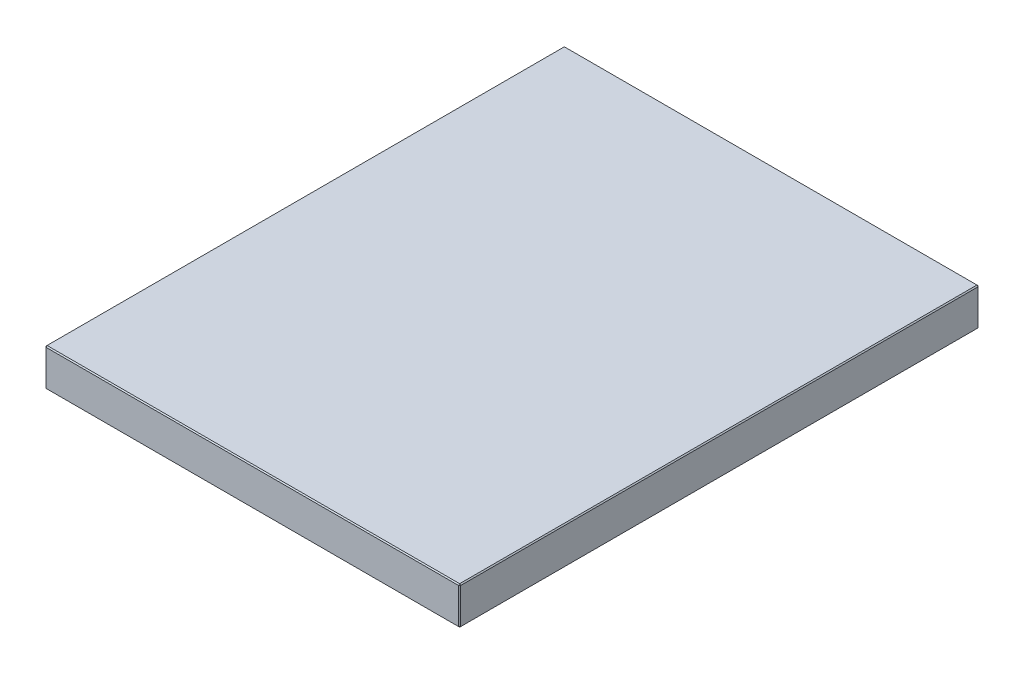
ISO-10303-21;
HEADER;
FILE_DESCRIPTION(('STEP AP214'),'2;1');
FILE_NAME('part.step','',(''),(''),'','','');
FILE_SCHEMA(('AUTOMOTIVE_DESIGN { 1 0 10303 214 1 1 1 1 }'));
ENDSEC;
DATA;
#1=APPLICATION_CONTEXT('core data for automotive mechanical design processes');
#2=APPLICATION_PROTOCOL_DEFINITION('international standard','automotive_design',2000,#1);
#3=PRODUCT_CONTEXT('',#1,'mechanical');
#4=PRODUCT('Part','Part','',(#3));
#5=PRODUCT_RELATED_PRODUCT_CATEGORY('part','',(#4));
#6=PRODUCT_DEFINITION_FORMATION('','',#4);
#7=PRODUCT_DEFINITION_CONTEXT('part definition',#1,'design');
#8=PRODUCT_DEFINITION('design','',#6,#7);
#9=PRODUCT_DEFINITION_SHAPE('','',#8);
#10=(LENGTH_UNIT() NAMED_UNIT(*) SI_UNIT(.MILLI.,.METRE.));
#11=(NAMED_UNIT(*) PLANE_ANGLE_UNIT() SI_UNIT($,.RADIAN.));
#12=(NAMED_UNIT(*) SI_UNIT($,.STERADIAN.) SOLID_ANGLE_UNIT());
#13=UNCERTAINTY_MEASURE_WITH_UNIT(LENGTH_MEASURE(1.E-05),#10,'distance_accuracy_value','');
#14=(GEOMETRIC_REPRESENTATION_CONTEXT(3) GLOBAL_UNCERTAINTY_ASSIGNED_CONTEXT((#13)) GLOBAL_UNIT_ASSIGNED_CONTEXT((#10,
#11,#12)) REPRESENTATION_CONTEXT('',''));
#15=CARTESIAN_POINT('',(0.,0.,0.));
#16=DIRECTION('',(0.,0.,1.));
#17=DIRECTION('',(1.,0.,0.));
#18=AXIS2_PLACEMENT_3D('',#15,#16,#17);
#19=CARTESIAN_POINT('',(-198.,36.,248.));
#20=DIRECTION('',(1.,0.,0.));
#21=DIRECTION('',(0.,0.,-1.));
#22=AXIS2_PLACEMENT_3D('',#19,#20,#21);
#23=PLANE('',#22);
#24=DIRECTION('',(0.,-1.,0.));
#25=VECTOR('',#24,1.);
#26=CARTESIAN_POINT('',(-198.,36.,-247.));
#27=LINE('',#26,#25);
#28=CARTESIAN_POINT('',(-198.,35.,-247.));
#29=VERTEX_POINT('',#28);
#30=CARTESIAN_POINT('',(-198.,1.00000000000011,-247.));
#31=VERTEX_POINT('',#30);
#32=EDGE_CURVE('E114',#29,#31,#27,.T.);
#33=ORIENTED_EDGE('',*,*,#32,.T.);
#34=DIRECTION('',(0.,0.,1.));
#35=VECTOR('',#34,1.);
#36=CARTESIAN_POINT('',(-198.,1.00000000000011,248.));
#37=LINE('',#36,#35);
#38=CARTESIAN_POINT('',(-198.,1.00000000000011,247.));
#39=VERTEX_POINT('',#38);
#40=EDGE_CURVE('E110',#31,#39,#37,.T.);
#41=ORIENTED_EDGE('',*,*,#40,.T.);
#42=DIRECTION('',(0.,1.,0.));
#43=VECTOR('',#42,1.);
#44=CARTESIAN_POINT('',(-198.,36.,247.));
#45=LINE('',#44,#43);
#46=CARTESIAN_POINT('',(-198.,35.,247.));
#47=VERTEX_POINT('',#46);
#48=EDGE_CURVE('E103',#39,#47,#45,.T.);
#49=ORIENTED_EDGE('',*,*,#48,.T.);
#50=DIRECTION('',(0.,0.,-1.));
#51=VECTOR('',#50,1.);
#52=CARTESIAN_POINT('',(-198.,35.,-248.));
#53=LINE('',#52,#51);
#54=EDGE_CURVE('E107',#47,#29,#53,.T.);
#55=ORIENTED_EDGE('',*,*,#54,.T.);
#56=EDGE_LOOP('',(#33,#41,#49,#55));
#57=FACE_BOUND('',#56,.T.);
#58=ADVANCED_FACE('F15',(#57),#23,.F.);
#59=CARTESIAN_POINT('',(198.,36.,248.));
#60=DIRECTION('',(0.,0.,-1.));
#61=DIRECTION('',(-1.,0.,0.));
#62=AXIS2_PLACEMENT_3D('',#59,#60,#61);
#63=PLANE('',#62);
#64=DIRECTION('',(-1.,0.,0.));
#65=VECTOR('',#64,1.);
#66=CARTESIAN_POINT('',(-198.,35.,248.));
#67=LINE('',#66,#65);
#68=CARTESIAN_POINT('',(197.,35.,248.));
#69=VERTEX_POINT('',#68);
#70=CARTESIAN_POINT('',(-197.,35.,248.));
#71=VERTEX_POINT('',#70);
#72=EDGE_CURVE('E164',#69,#71,#67,.T.);
#73=ORIENTED_EDGE('',*,*,#72,.T.);
#74=DIRECTION('',(0.,-1.,0.));
#75=VECTOR('',#74,1.);
#76=CARTESIAN_POINT('',(-197.,36.,248.));
#77=LINE('',#76,#75);
#78=CARTESIAN_POINT('',(-197.,1.00000000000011,248.));
#79=VERTEX_POINT('',#78);
#80=EDGE_CURVE('E122',#71,#79,#77,.T.);
#81=ORIENTED_EDGE('',*,*,#80,.T.);
#82=DIRECTION('',(1.,0.,0.));
#83=VECTOR('',#82,1.);
#84=CARTESIAN_POINT('',(198.,1.00000000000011,248.));
#85=LINE('',#84,#83);
#86=CARTESIAN_POINT('',(197.,1.00000000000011,248.));
#87=VERTEX_POINT('',#86);
#88=EDGE_CURVE('E168',#79,#87,#85,.T.);
#89=ORIENTED_EDGE('',*,*,#88,.T.);
#90=DIRECTION('',(0.,1.,0.));
#91=VECTOR('',#90,1.);
#92=CARTESIAN_POINT('',(197.,36.,248.));
#93=LINE('',#92,#91);
#94=EDGE_CURVE('E166',#87,#69,#93,.T.);
#95=ORIENTED_EDGE('',*,*,#94,.T.);
#96=EDGE_LOOP('',(#73,#81,#89,#95));
#97=FACE_BOUND('',#96,.T.);
#98=ADVANCED_FACE('F275',(#97),#63,.F.);
#99=CARTESIAN_POINT('',(198.,36.,248.));
#100=DIRECTION('',(-1.,0.,0.));
#101=DIRECTION('',(0.,0.,1.));
#102=AXIS2_PLACEMENT_3D('',#99,#100,#101);
#103=PLANE('',#102);
#104=DIRECTION('',(0.,0.,-1.));
#105=VECTOR('',#104,1.);
#106=CARTESIAN_POINT('',(198.,1.00000000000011,248.));
#107=LINE('',#106,#105);
#108=CARTESIAN_POINT('',(198.,1.00000000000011,247.));
#109=VERTEX_POINT('',#108);
#110=CARTESIAN_POINT('',(198.,1.00000000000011,-247.));
#111=VERTEX_POINT('',#110);
#112=EDGE_CURVE('E159',#109,#111,#107,.T.);
#113=ORIENTED_EDGE('',*,*,#112,.T.);
#114=DIRECTION('',(0.,1.,0.));
#115=VECTOR('',#114,1.);
#116=CARTESIAN_POINT('',(198.,36.,-247.));
#117=LINE('',#116,#115);
#118=CARTESIAN_POINT('',(198.,35.,-247.));
#119=VERTEX_POINT('',#118);
#120=EDGE_CURVE('E161',#111,#119,#117,.T.);
#121=ORIENTED_EDGE('',*,*,#120,.T.);
#122=DIRECTION('',(0.,0.,1.));
#123=VECTOR('',#122,1.);
#124=CARTESIAN_POINT('',(198.,35.,248.));
#125=LINE('',#124,#123);
#126=CARTESIAN_POINT('',(198.,35.,247.));
#127=VERTEX_POINT('',#126);
#128=EDGE_CURVE('E155',#119,#127,#125,.T.);
#129=ORIENTED_EDGE('',*,*,#128,.T.);
#130=DIRECTION('',(0.,-1.,0.));
#131=VECTOR('',#130,1.);
#132=CARTESIAN_POINT('',(198.,36.,247.));
#133=LINE('',#132,#131);
#134=EDGE_CURVE('E157',#127,#109,#133,.T.);
#135=ORIENTED_EDGE('',*,*,#134,.T.);
#136=EDGE_LOOP('',(#113,#121,#129,#135));
#137=FACE_BOUND('',#136,.T.);
#138=ADVANCED_FACE('F254',(#137),#103,.F.);
#139=CARTESIAN_POINT('',(198.,36.,-248.));
#140=DIRECTION('',(0.,0.,1.));
#141=DIRECTION('',(1.,0.,0.));
#142=AXIS2_PLACEMENT_3D('',#139,#140,#141);
#143=PLANE('',#142);
#144=DIRECTION('',(0.,-1.,0.));
#145=VECTOR('',#144,1.);
#146=CARTESIAN_POINT('',(197.,36.,-248.));
#147=LINE('',#146,#145);
#148=CARTESIAN_POINT('',(197.,35.,-248.));
#149=VERTEX_POINT('',#148);
#150=CARTESIAN_POINT('',(197.,1.00000000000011,-248.));
#151=VERTEX_POINT('',#150);
#152=EDGE_CURVE('E148',#149,#151,#147,.T.);
#153=ORIENTED_EDGE('',*,*,#152,.T.);
#154=DIRECTION('',(-1.,0.,0.));
#155=VECTOR('',#154,1.);
#156=CARTESIAN_POINT('',(198.,1.00000000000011,-248.));
#157=LINE('',#156,#155);
#158=CARTESIAN_POINT('',(-197.,1.00000000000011,-248.));
#159=VERTEX_POINT('',#158);
#160=EDGE_CURVE('E153',#151,#159,#157,.T.);
#161=ORIENTED_EDGE('',*,*,#160,.T.);
#162=DIRECTION('',(0.,1.,0.));
#163=VECTOR('',#162,1.);
#164=CARTESIAN_POINT('',(-197.,36.,-248.));
#165=LINE('',#164,#163);
#166=CARTESIAN_POINT('',(-197.,35.,-248.));
#167=VERTEX_POINT('',#166);
#168=EDGE_CURVE('E150',#159,#167,#165,.T.);
#169=ORIENTED_EDGE('',*,*,#168,.T.);
#170=DIRECTION('',(1.,0.,0.));
#171=VECTOR('',#170,1.);
#172=CARTESIAN_POINT('',(198.,35.,-248.));
#173=LINE('',#172,#171);
#174=EDGE_CURVE('E146',#167,#149,#173,.T.);
#175=ORIENTED_EDGE('',*,*,#174,.T.);
#176=EDGE_LOOP('',(#153,#161,#169,#175));
#177=FACE_BOUND('',#176,.T.);
#178=ADVANCED_FACE('F284',(#177),#143,.F.);
#179=CARTESIAN_POINT('',(0.,36.,0.));
#180=DIRECTION('',(0.,1.,0.));
#181=DIRECTION('',(0.,0.,1.));
#182=AXIS2_PLACEMENT_3D('',#179,#180,#181);
#183=PLANE('',#182);
#184=DIRECTION('',(0.,0.,-1.));
#185=VECTOR('',#184,1.);
#186=CARTESIAN_POINT('',(197.,36.,-248.));
#187=LINE('',#186,#185);
#188=CARTESIAN_POINT('',(197.,36.,247.));
#189=VERTEX_POINT('',#188);
#190=CARTESIAN_POINT('',(197.,36.,-247.));
#191=VERTEX_POINT('',#190);
#192=EDGE_CURVE('E24',#189,#191,#187,.T.);
#193=ORIENTED_EDGE('',*,*,#192,.T.);
#194=DIRECTION('',(-1.,0.,0.));
#195=VECTOR('',#194,1.);
#196=CARTESIAN_POINT('',(-198.,36.,-247.));
#197=LINE('',#196,#195);
#198=CARTESIAN_POINT('',(-197.,36.,-247.));
#199=VERTEX_POINT('',#198);
#200=EDGE_CURVE('E9',#191,#199,#197,.T.);
#201=ORIENTED_EDGE('',*,*,#200,.T.);
#202=DIRECTION('',(0.,0.,1.));
#203=VECTOR('',#202,1.);
#204=CARTESIAN_POINT('',(-197.,36.,248.));
#205=LINE('',#204,#203);
#206=CARTESIAN_POINT('',(-197.,36.,247.));
#207=VERTEX_POINT('',#206);
#208=EDGE_CURVE('E180',#199,#207,#205,.T.);
#209=ORIENTED_EDGE('',*,*,#208,.T.);
#210=DIRECTION('',(1.,0.,0.));
#211=VECTOR('',#210,1.);
#212=CARTESIAN_POINT('',(198.,36.,247.));
#213=LINE('',#212,#211);
#214=EDGE_CURVE('E35',#207,#189,#213,.T.);
#215=ORIENTED_EDGE('',*,*,#214,.T.);
#216=EDGE_LOOP('',(#193,#201,#209,#215));
#217=FACE_BOUND('',#216,.T.);
#218=ADVANCED_FACE('F350',(#217),#183,.T.);
#219=CARTESIAN_POINT('',(0.,0.,0.));
#220=DIRECTION('',(0.,1.,0.));
#221=DIRECTION('',(0.,0.,1.));
#222=AXIS2_PLACEMENT_3D('',#219,#220,#221);
#223=PLANE('',#222);
#224=DIRECTION('',(0.,0.,1.));
#225=VECTOR('',#224,1.);
#226=CARTESIAN_POINT('',(197.,0.,0.));
#227=LINE('',#226,#225);
#228=CARTESIAN_POINT('',(197.,0.,-247.));
#229=VERTEX_POINT('',#228);
#230=CARTESIAN_POINT('',(197.,0.,247.));
#231=VERTEX_POINT('',#230);
#232=EDGE_CURVE('E171',#229,#231,#227,.T.);
#233=ORIENTED_EDGE('',*,*,#232,.T.);
#234=DIRECTION('',(-1.,0.,0.));
#235=VECTOR('',#234,1.);
#236=CARTESIAN_POINT('',(0.,0.,247.));
#237=LINE('',#236,#235);
#238=CARTESIAN_POINT('',(-197.,0.,247.));
#239=VERTEX_POINT('',#238);
#240=EDGE_CURVE('E177',#231,#239,#237,.T.);
#241=ORIENTED_EDGE('',*,*,#240,.T.);
#242=DIRECTION('',(0.,0.,-1.));
#243=VECTOR('',#242,1.);
#244=CARTESIAN_POINT('',(-197.,0.,0.));
#245=LINE('',#244,#243);
#246=CARTESIAN_POINT('',(-197.,0.,-247.));
#247=VERTEX_POINT('',#246);
#248=EDGE_CURVE('E175',#239,#247,#245,.T.);
#249=ORIENTED_EDGE('',*,*,#248,.T.);
#250=DIRECTION('',(1.,0.,0.));
#251=VECTOR('',#250,1.);
#252=CARTESIAN_POINT('',(0.,0.,-247.));
#253=LINE('',#252,#251);
#254=EDGE_CURVE('E173',#247,#229,#253,.T.);
#255=ORIENTED_EDGE('',*,*,#254,.T.);
#256=EDGE_LOOP('',(#233,#241,#249,#255));
#257=FACE_BOUND('',#256,.T.);
#258=ADVANCED_FACE('F246',(#257),#223,.F.);
#259=CARTESIAN_POINT('',(198.,36.,247.));
#260=DIRECTION('',(-0.707106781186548,0.,-0.707106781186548));
#261=DIRECTION('',(0.,-1.,0.));
#262=AXIS2_PLACEMENT_3D('',#259,#260,#261);
#263=PLANE('',#262);
#264=DIRECTION('',(-0.707106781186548,0.,0.707106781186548));
#265=VECTOR('',#264,1.);
#266=CARTESIAN_POINT('',(197.,35.,248.));
#267=LINE('',#266,#265);
#268=EDGE_CURVE('E19',#69,#127,#267,.F.);
#269=ORIENTED_EDGE('',*,*,#268,.F.);
#270=ORIENTED_EDGE('',*,*,#94,.F.);
#271=DIRECTION('',(0.707106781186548,0.,-0.707106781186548));
#272=VECTOR('',#271,1.);
#273=CARTESIAN_POINT('',(197.,1.00000000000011,248.));
#274=LINE('',#273,#272);
#275=EDGE_CURVE('E142',#109,#87,#274,.F.);
#276=ORIENTED_EDGE('',*,*,#275,.F.);
#277=ORIENTED_EDGE('',*,*,#134,.F.);
#278=EDGE_LOOP('',(#269,#270,#276,#277));
#279=FACE_BOUND('',#278,.T.);
#280=ADVANCED_FACE('F17',(#279),#263,.F.);
#281=CARTESIAN_POINT('',(197.,35.,248.));
#282=DIRECTION('',(0.577350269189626,0.577350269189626,0.577350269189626));
#283=DIRECTION('',(0.707106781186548,0.,-0.707106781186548));
#284=AXIS2_PLACEMENT_3D('',#281,#282,#283);
#285=PLANE('',#284);
#286=DIRECTION('',(0.,-0.707106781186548,0.707106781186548));
#287=VECTOR('',#286,1.);
#288=CARTESIAN_POINT('',(197.,35.,248.));
#289=LINE('',#288,#287);
#290=EDGE_CURVE('E226',#69,#189,#289,.F.);
#291=ORIENTED_EDGE('',*,*,#290,.F.);
#292=ORIENTED_EDGE('',*,*,#268,.T.);
#293=DIRECTION('',(-0.707106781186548,0.707106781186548,0.));
#294=VECTOR('',#293,1.);
#295=CARTESIAN_POINT('',(197.5,35.5,247.));
#296=LINE('',#295,#294);
#297=EDGE_CURVE('E228',#189,#127,#296,.F.);
#298=ORIENTED_EDGE('',*,*,#297,.F.);
#299=EDGE_LOOP('',(#291,#292,#298));
#300=FACE_BOUND('',#299,.T.);
#301=ADVANCED_FACE('F270',(#300),#285,.T.);
#302=CARTESIAN_POINT('',(197.,1.00000000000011,248.));
#303=DIRECTION('',(0.577350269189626,-0.577350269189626,0.577350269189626));
#304=DIRECTION('',(0.707106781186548,0.,-0.707106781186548));
#305=AXIS2_PLACEMENT_3D('',#302,#303,#304);
#306=PLANE('',#305);
#307=DIRECTION('',(-0.707106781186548,-0.707106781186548,0.));
#308=VECTOR('',#307,1.);
#309=CARTESIAN_POINT('',(197.5,0.500000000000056,247.));
#310=LINE('',#309,#308);
#311=EDGE_CURVE('E220',#109,#231,#310,.T.);
#312=ORIENTED_EDGE('',*,*,#311,.F.);
#313=ORIENTED_EDGE('',*,*,#275,.T.);
#314=DIRECTION('',(0.,0.707106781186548,0.707106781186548));
#315=VECTOR('',#314,1.);
#316=CARTESIAN_POINT('',(197.,1.00000000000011,248.));
#317=LINE('',#316,#315);
#318=EDGE_CURVE('E223',#231,#87,#317,.T.);
#319=ORIENTED_EDGE('',*,*,#318,.F.);
#320=EDGE_LOOP('',(#312,#313,#319));
#321=FACE_BOUND('',#320,.T.);
#322=ADVANCED_FACE('F235',(#321),#306,.T.);
#323=CARTESIAN_POINT('',(197.,36.,0.));
#324=DIRECTION('',(0.707106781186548,0.707106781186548,0.));
#325=DIRECTION('',(0.,0.,1.));
#326=AXIS2_PLACEMENT_3D('',#323,#324,#325);
#327=PLANE('',#326);
#328=ORIENTED_EDGE('',*,*,#297,.T.);
#329=ORIENTED_EDGE('',*,*,#128,.F.);
#330=DIRECTION('',(0.707106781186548,-0.707106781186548,0.));
#331=VECTOR('',#330,1.);
#332=CARTESIAN_POINT('',(198.,35.,-247.));
#333=LINE('',#332,#331);
#334=EDGE_CURVE('E215',#191,#119,#333,.T.);
#335=ORIENTED_EDGE('',*,*,#334,.F.);
#336=ORIENTED_EDGE('',*,*,#192,.F.);
#337=EDGE_LOOP('',(#328,#329,#335,#336));
#338=FACE_BOUND('',#337,.T.);
#339=ADVANCED_FACE('F265',(#338),#327,.T.);
#340=CARTESIAN_POINT('',(0.,36.,247.));
#341=DIRECTION('',(0.,0.707106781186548,0.707106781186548));
#342=DIRECTION('',(-1.,0.,0.));
#343=AXIS2_PLACEMENT_3D('',#340,#341,#342);
#344=PLANE('',#343);
#345=ORIENTED_EDGE('',*,*,#290,.T.);
#346=ORIENTED_EDGE('',*,*,#214,.F.);
#347=DIRECTION('',(0.,0.707106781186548,-0.707106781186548));
#348=VECTOR('',#347,1.);
#349=CARTESIAN_POINT('',(-197.,35.5,247.5));
#350=LINE('',#349,#348);
#351=EDGE_CURVE('E126',#71,#207,#350,.T.);
#352=ORIENTED_EDGE('',*,*,#351,.F.);
#353=ORIENTED_EDGE('',*,*,#72,.F.);
#354=EDGE_LOOP('',(#345,#346,#352,#353));
#355=FACE_BOUND('',#354,.T.);
#356=ADVANCED_FACE('F273',(#355),#344,.T.);
#357=CARTESIAN_POINT('',(-197.,36.,248.));
#358=DIRECTION('',(0.707106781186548,0.,-0.707106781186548));
#359=DIRECTION('',(0.,-1.,0.));
#360=AXIS2_PLACEMENT_3D('',#357,#358,#359);
#361=PLANE('',#360);
#362=DIRECTION('',(0.707106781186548,0.,0.707106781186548));
#363=VECTOR('',#362,1.);
#364=CARTESIAN_POINT('',(-197.,1.00000000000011,248.));
#365=LINE('',#364,#363);
#366=EDGE_CURVE('E127',#79,#39,#365,.F.);
#367=ORIENTED_EDGE('',*,*,#366,.F.);
#368=ORIENTED_EDGE('',*,*,#80,.F.);
#369=DIRECTION('',(-0.707106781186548,0.,-0.707106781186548));
#370=VECTOR('',#369,1.);
#371=CARTESIAN_POINT('',(-198.,35.,247.));
#372=LINE('',#371,#370);
#373=EDGE_CURVE('E118',#47,#71,#372,.F.);
#374=ORIENTED_EDGE('',*,*,#373,.F.);
#375=ORIENTED_EDGE('',*,*,#48,.F.);
#376=EDGE_LOOP('',(#367,#368,#374,#375));
#377=FACE_BOUND('',#376,.T.);
#378=ADVANCED_FACE('F120',(#377),#361,.F.);
#379=CARTESIAN_POINT('',(198.,1.00000000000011,248.));
#380=DIRECTION('',(0.,0.707106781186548,-0.707106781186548));
#381=DIRECTION('',(1.,0.,0.));
#382=AXIS2_PLACEMENT_3D('',#379,#380,#381);
#383=PLANE('',#382);
#384=ORIENTED_EDGE('',*,*,#318,.T.);
#385=ORIENTED_EDGE('',*,*,#88,.F.);
#386=DIRECTION('',(0.,-0.707106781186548,-0.707106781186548));
#387=VECTOR('',#386,1.);
#388=CARTESIAN_POINT('',(-197.,1.00000000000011,248.));
#389=LINE('',#388,#387);
#390=EDGE_CURVE('E211',#239,#79,#389,.F.);
#391=ORIENTED_EDGE('',*,*,#390,.F.);
#392=ORIENTED_EDGE('',*,*,#240,.F.);
#393=EDGE_LOOP('',(#384,#385,#391,#392));
#394=FACE_BOUND('',#393,.T.);
#395=ADVANCED_FACE('F243',(#394),#383,.F.);
#396=CARTESIAN_POINT('',(198.,1.00000000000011,248.));
#397=DIRECTION('',(-0.707106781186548,0.707106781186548,0.));
#398=DIRECTION('',(0.,0.,-1.));
#399=AXIS2_PLACEMENT_3D('',#396,#397,#398);
#400=PLANE('',#399);
#401=ORIENTED_EDGE('',*,*,#311,.T.);
#402=ORIENTED_EDGE('',*,*,#232,.F.);
#403=DIRECTION('',(0.707106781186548,0.707106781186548,0.));
#404=VECTOR('',#403,1.);
#405=CARTESIAN_POINT('',(197.5,0.50000000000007,-247.));
#406=LINE('',#405,#404);
#407=EDGE_CURVE('E208',#111,#229,#406,.F.);
#408=ORIENTED_EDGE('',*,*,#407,.F.);
#409=ORIENTED_EDGE('',*,*,#112,.F.);
#410=EDGE_LOOP('',(#401,#402,#408,#409));
#411=FACE_BOUND('',#410,.T.);
#412=ADVANCED_FACE('F251',(#411),#400,.F.);
#413=CARTESIAN_POINT('',(197.,36.,-248.));
#414=DIRECTION('',(-0.707106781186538,0.,0.707106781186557));
#415=DIRECTION('',(0.,-1.,0.));
#416=AXIS2_PLACEMENT_3D('',#413,#414,#415);
#417=PLANE('',#416);
#418=DIRECTION('',(0.707106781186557,0.,0.707106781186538));
#419=VECTOR('',#418,1.);
#420=CARTESIAN_POINT('',(198.,35.,-247.));
#421=LINE('',#420,#419);
#422=EDGE_CURVE('E217',#119,#149,#421,.F.);
#423=ORIENTED_EDGE('',*,*,#422,.F.);
#424=ORIENTED_EDGE('',*,*,#120,.F.);
#425=DIRECTION('',(-0.707106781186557,0.,-0.707106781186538));
#426=VECTOR('',#425,1.);
#427=CARTESIAN_POINT('',(197.,1.00000000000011,-248.));
#428=LINE('',#427,#426);
#429=EDGE_CURVE('E205',#151,#111,#428,.F.);
#430=ORIENTED_EDGE('',*,*,#429,.F.);
#431=ORIENTED_EDGE('',*,*,#152,.F.);
#432=EDGE_LOOP('',(#423,#424,#430,#431));
#433=FACE_BOUND('',#432,.T.);
#434=ADVANCED_FACE('F258',(#433),#417,.F.);
#435=CARTESIAN_POINT('',(198.,35.,-247.));
#436=DIRECTION('',(0.577350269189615,0.577350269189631,-0.577350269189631));
#437=DIRECTION('',(0.,0.707106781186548,0.707106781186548));
#438=AXIS2_PLACEMENT_3D('',#435,#436,#437);
#439=PLANE('',#438);
#440=ORIENTED_EDGE('',*,*,#334,.T.);
#441=ORIENTED_EDGE('',*,*,#422,.T.);
#442=DIRECTION('',(0.,0.707106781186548,0.707106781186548));
#443=VECTOR('',#442,1.);
#444=CARTESIAN_POINT('',(197.,35.5,-247.5));
#445=LINE('',#444,#443);
#446=EDGE_CURVE('E134',#191,#149,#445,.F.);
#447=ORIENTED_EDGE('',*,*,#446,.F.);
#448=EDGE_LOOP('',(#440,#441,#447));
#449=FACE_BOUND('',#448,.T.);
#450=ADVANCED_FACE('F325',(#449),#439,.T.);
#451=CARTESIAN_POINT('',(-198.,35.,247.));
#452=DIRECTION('',(-0.577350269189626,0.577350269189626,0.577350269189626));
#453=DIRECTION('',(0.707106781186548,0.,0.707106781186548));
#454=AXIS2_PLACEMENT_3D('',#451,#452,#453);
#455=PLANE('',#454);
#456=ORIENTED_EDGE('',*,*,#373,.T.);
#457=ORIENTED_EDGE('',*,*,#351,.T.);
#458=DIRECTION('',(-0.707106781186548,-0.707106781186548,0.));
#459=VECTOR('',#458,1.);
#460=CARTESIAN_POINT('',(-198.,35.,247.));
#461=LINE('',#460,#459);
#462=EDGE_CURVE('E130',#47,#207,#461,.F.);
#463=ORIENTED_EDGE('',*,*,#462,.F.);
#464=EDGE_LOOP('',(#456,#457,#463));
#465=FACE_BOUND('',#464,.T.);
#466=ADVANCED_FACE('F131',(#465),#455,.T.);
#467=CARTESIAN_POINT('',(-197.,1.00000000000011,248.));
#468=DIRECTION('',(-0.577350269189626,-0.577350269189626,0.577350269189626));
#469=DIRECTION('',(0.707106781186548,0.,0.707106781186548));
#470=AXIS2_PLACEMENT_3D('',#467,#468,#469);
#471=PLANE('',#470);
#472=ORIENTED_EDGE('',*,*,#390,.T.);
#473=ORIENTED_EDGE('',*,*,#366,.T.);
#474=DIRECTION('',(-0.707106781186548,0.707106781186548,0.));
#475=VECTOR('',#474,1.);
#476=CARTESIAN_POINT('',(-197.5,0.500000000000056,247.));
#477=LINE('',#476,#475);
#478=EDGE_CURVE('E135',#239,#39,#477,.T.);
#479=ORIENTED_EDGE('',*,*,#478,.F.);
#480=EDGE_LOOP('',(#472,#473,#479));
#481=FACE_BOUND('',#480,.T.);
#482=ADVANCED_FACE('F318',(#481),#471,.T.);
#483=CARTESIAN_POINT('',(197.,1.00000000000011,-248.));
#484=DIRECTION('',(0.577350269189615,-0.577350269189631,-0.577350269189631));
#485=DIRECTION('',(0.,0.707106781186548,-0.707106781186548));
#486=AXIS2_PLACEMENT_3D('',#483,#484,#485);
#487=PLANE('',#486);
#488=ORIENTED_EDGE('',*,*,#429,.T.);
#489=ORIENTED_EDGE('',*,*,#407,.T.);
#490=DIRECTION('',(0.,-0.707106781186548,0.707106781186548));
#491=VECTOR('',#490,1.);
#492=CARTESIAN_POINT('',(197.,1.00000000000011,-248.));
#493=LINE('',#492,#491);
#494=EDGE_CURVE('E198',#151,#229,#493,.T.);
#495=ORIENTED_EDGE('',*,*,#494,.F.);
#496=EDGE_LOOP('',(#488,#489,#495));
#497=FACE_BOUND('',#496,.T.);
#498=ADVANCED_FACE('F314',(#497),#487,.T.);
#499=CARTESIAN_POINT('',(0.,36.,-247.));
#500=DIRECTION('',(0.,0.707106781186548,-0.707106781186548));
#501=DIRECTION('',(1.,0.,0.));
#502=AXIS2_PLACEMENT_3D('',#499,#500,#501);
#503=PLANE('',#502);
#504=ORIENTED_EDGE('',*,*,#446,.T.);
#505=ORIENTED_EDGE('',*,*,#174,.F.);
#506=DIRECTION('',(0.,-0.707106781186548,-0.707106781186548));
#507=VECTOR('',#506,1.);
#508=CARTESIAN_POINT('',(-197.,35.,-248.));
#509=LINE('',#508,#507);
#510=EDGE_CURVE('E195',#199,#167,#509,.T.);
#511=ORIENTED_EDGE('',*,*,#510,.F.);
#512=ORIENTED_EDGE('',*,*,#200,.F.);
#513=EDGE_LOOP('',(#504,#505,#511,#512));
#514=FACE_BOUND('',#513,.T.);
#515=ADVANCED_FACE('F311',(#514),#503,.T.);
#516=CARTESIAN_POINT('',(-197.,36.,0.));
#517=DIRECTION('',(-0.707106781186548,0.707106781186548,0.));
#518=DIRECTION('',(0.,0.,-1.));
#519=AXIS2_PLACEMENT_3D('',#516,#517,#518);
#520=PLANE('',#519);
#521=ORIENTED_EDGE('',*,*,#462,.T.);
#522=ORIENTED_EDGE('',*,*,#208,.F.);
#523=DIRECTION('',(0.707106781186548,0.707106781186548,0.));
#524=VECTOR('',#523,1.);
#525=CARTESIAN_POINT('',(-197.5,35.5,-247.));
#526=LINE('',#525,#524);
#527=EDGE_CURVE('E138',#29,#199,#526,.T.);
#528=ORIENTED_EDGE('',*,*,#527,.F.);
#529=ORIENTED_EDGE('',*,*,#54,.F.);
#530=EDGE_LOOP('',(#521,#522,#528,#529));
#531=FACE_BOUND('',#530,.T.);
#532=ADVANCED_FACE('F137',(#531),#520,.T.);
#533=CARTESIAN_POINT('',(-198.,1.00000000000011,248.));
#534=DIRECTION('',(0.707106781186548,0.707106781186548,0.));
#535=DIRECTION('',(0.,0.,1.));
#536=AXIS2_PLACEMENT_3D('',#533,#534,#535);
#537=PLANE('',#536);
#538=ORIENTED_EDGE('',*,*,#478,.T.);
#539=ORIENTED_EDGE('',*,*,#40,.F.);
#540=DIRECTION('',(0.707106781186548,-0.707106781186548,0.));
#541=VECTOR('',#540,1.);
#542=CARTESIAN_POINT('',(-198.,1.00000000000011,-247.));
#543=LINE('',#542,#541);
#544=EDGE_CURVE('E191',#247,#31,#543,.F.);
#545=ORIENTED_EDGE('',*,*,#544,.F.);
#546=ORIENTED_EDGE('',*,*,#248,.F.);
#547=EDGE_LOOP('',(#538,#539,#545,#546));
#548=FACE_BOUND('',#547,.T.);
#549=ADVANCED_FACE('F304',(#548),#537,.F.);
#550=CARTESIAN_POINT('',(198.,1.00000000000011,-248.));
#551=DIRECTION('',(0.,0.707106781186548,0.707106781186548));
#552=DIRECTION('',(-1.,0.,0.));
#553=AXIS2_PLACEMENT_3D('',#550,#551,#552);
#554=PLANE('',#553);
#555=ORIENTED_EDGE('',*,*,#494,.T.);
#556=ORIENTED_EDGE('',*,*,#254,.F.);
#557=DIRECTION('',(0.,0.707106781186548,-0.707106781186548));
#558=VECTOR('',#557,1.);
#559=CARTESIAN_POINT('',(-197.,0.500000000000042,-247.5));
#560=LINE('',#559,#558);
#561=EDGE_CURVE('E188',#159,#247,#560,.F.);
#562=ORIENTED_EDGE('',*,*,#561,.F.);
#563=ORIENTED_EDGE('',*,*,#160,.F.);
#564=EDGE_LOOP('',(#555,#556,#562,#563));
#565=FACE_BOUND('',#564,.T.);
#566=ADVANCED_FACE('F300',(#565),#554,.F.);
#567=CARTESIAN_POINT('',(-197.,35.,-248.));
#568=DIRECTION('',(-0.577350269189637,0.577350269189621,-0.577350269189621));
#569=DIRECTION('',(-0.707106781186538,0.,0.707106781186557));
#570=AXIS2_PLACEMENT_3D('',#567,#568,#569);
#571=PLANE('',#570);
#572=ORIENTED_EDGE('',*,*,#527,.T.);
#573=ORIENTED_EDGE('',*,*,#510,.T.);
#574=DIRECTION('',(0.707106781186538,0.,-0.707106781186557));
#575=VECTOR('',#574,1.);
#576=CARTESIAN_POINT('',(-197.,35.,-248.));
#577=LINE('',#576,#575);
#578=EDGE_CURVE('E186',#29,#167,#577,.T.);
#579=ORIENTED_EDGE('',*,*,#578,.F.);
#580=EDGE_LOOP('',(#572,#573,#579));
#581=FACE_BOUND('',#580,.T.);
#582=ADVANCED_FACE('F296',(#581),#571,.T.);
#583=CARTESIAN_POINT('',(-198.,1.00000000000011,-247.));
#584=DIRECTION('',(-0.577350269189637,-0.577350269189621,-0.577350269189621));
#585=DIRECTION('',(-0.707106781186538,0.,0.707106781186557));
#586=AXIS2_PLACEMENT_3D('',#583,#584,#585);
#587=PLANE('',#586);
#588=ORIENTED_EDGE('',*,*,#561,.T.);
#589=ORIENTED_EDGE('',*,*,#544,.T.);
#590=DIRECTION('',(-0.707106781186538,0.,0.707106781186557));
#591=VECTOR('',#590,1.);
#592=CARTESIAN_POINT('',(-198.,1.00000000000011,-247.));
#593=LINE('',#592,#591);
#594=EDGE_CURVE('E184',#159,#31,#593,.T.);
#595=ORIENTED_EDGE('',*,*,#594,.F.);
#596=EDGE_LOOP('',(#588,#589,#595));
#597=FACE_BOUND('',#596,.T.);
#598=ADVANCED_FACE('F292',(#597),#587,.T.);
#599=CARTESIAN_POINT('',(-198.,36.,-247.));
#600=DIRECTION('',(0.707106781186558,0.,0.707106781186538));
#601=DIRECTION('',(0.,-1.,0.));
#602=AXIS2_PLACEMENT_3D('',#599,#600,#601);
#603=PLANE('',#602);
#604=ORIENTED_EDGE('',*,*,#578,.T.);
#605=ORIENTED_EDGE('',*,*,#168,.F.);
#606=ORIENTED_EDGE('',*,*,#594,.T.);
#607=ORIENTED_EDGE('',*,*,#32,.F.);
#608=EDGE_LOOP('',(#604,#605,#606,#607));
#609=FACE_BOUND('',#608,.T.);
#610=ADVANCED_FACE('F289',(#609),#603,.F.);
#611=CLOSED_SHELL('',(#58,#98,#138,#178,#218,#258,#280,#301,#322,#339,#356,#378,#395,#412,#434,
#450,#466,#482,#498,#515,#532,#549,#566,#582,#598,#610));
#612=MANIFOLD_SOLID_BREP('B1',#611);
#613=ADVANCED_BREP_SHAPE_REPRESENTATION('',(#18,#612),#14);
#614=SHAPE_DEFINITION_REPRESENTATION(#9,#613);
ENDSEC;
END-ISO-10303-21;
